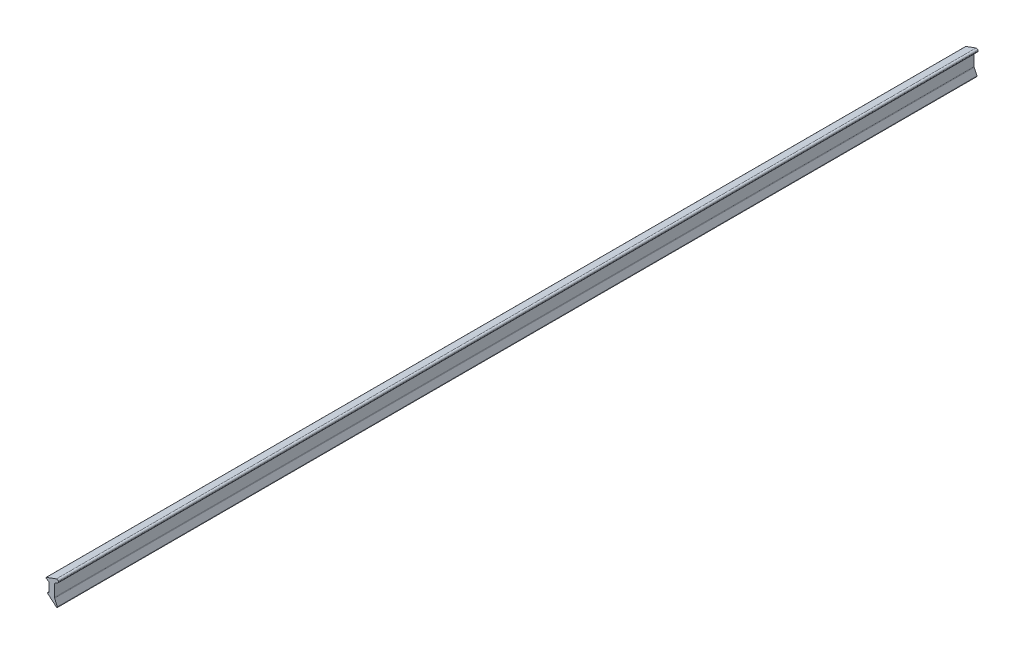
ISO-10303-21;
HEADER;
FILE_DESCRIPTION(('STEP AP214'),'2;1');
FILE_NAME('part.step','',(''),(''),'','','');
FILE_SCHEMA(('AUTOMOTIVE_DESIGN { 1 0 10303 214 1 1 1 1 }'));
ENDSEC;
DATA;
#1=APPLICATION_CONTEXT('core data for automotive mechanical design processes');
#2=APPLICATION_PROTOCOL_DEFINITION('international standard','automotive_design',2000,#1);
#3=PRODUCT_CONTEXT('',#1,'mechanical');
#4=PRODUCT('Part','Part','',(#3));
#5=PRODUCT_RELATED_PRODUCT_CATEGORY('part','',(#4));
#6=PRODUCT_DEFINITION_FORMATION('','',#4);
#7=PRODUCT_DEFINITION_CONTEXT('part definition',#1,'design');
#8=PRODUCT_DEFINITION('design','',#6,#7);
#9=PRODUCT_DEFINITION_SHAPE('','',#8);
#10=(LENGTH_UNIT() NAMED_UNIT(*) SI_UNIT(.MILLI.,.METRE.));
#11=(NAMED_UNIT(*) PLANE_ANGLE_UNIT() SI_UNIT($,.RADIAN.));
#12=(NAMED_UNIT(*) SI_UNIT($,.STERADIAN.) SOLID_ANGLE_UNIT());
#13=UNCERTAINTY_MEASURE_WITH_UNIT(LENGTH_MEASURE(1.E-05),#10,'distance_accuracy_value','');
#14=(GEOMETRIC_REPRESENTATION_CONTEXT(3) GLOBAL_UNCERTAINTY_ASSIGNED_CONTEXT((#13)) GLOBAL_UNIT_ASSIGNED_CONTEXT((#10,
#11,#12)) REPRESENTATION_CONTEXT('',''));
#15=CARTESIAN_POINT('',(0.,0.,0.));
#16=DIRECTION('',(0.,0.,1.));
#17=DIRECTION('',(1.,0.,0.));
#18=AXIS2_PLACEMENT_3D('',#15,#16,#17);
#19=CARTESIAN_POINT('',(0.,0.,150.));
#20=DIRECTION('',(0.324427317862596,-0.945910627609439,0.));
#21=DIRECTION('',(0.945910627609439,0.324427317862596,0.));
#22=AXIS2_PLACEMENT_3D('',#19,#20,#21);
#23=PLANE('',#22);
#24=DIRECTION('',(-0.945910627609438,-0.324427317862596,0.));
#25=VECTOR('',#24,1.);
#26=CARTESIAN_POINT('',(0.,0.,-150.));
#27=LINE('',#26,#25);
#28=CARTESIAN_POINT('',(0.,0.,-150.));
#29=VERTEX_POINT('',#28);
#30=CARTESIAN_POINT('',(-0.423103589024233,-0.145115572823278,-150.));
#31=VERTEX_POINT('',#30);
#32=EDGE_CURVE('E186',#29,#31,#27,.T.);
#33=ORIENTED_EDGE('',*,*,#32,.T.);
#34=DIRECTION('',(0.,0.,-1.));
#35=VECTOR('',#34,1.);
#36=CARTESIAN_POINT('',(-0.423103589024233,-0.145115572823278,150.));
#37=LINE('',#36,#35);
#38=CARTESIAN_POINT('',(-0.423103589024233,-0.145115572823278,150.));
#39=VERTEX_POINT('',#38);
#40=EDGE_CURVE('E52',#31,#39,#37,.F.);
#41=ORIENTED_EDGE('',*,*,#40,.T.);
#42=DIRECTION('',(-0.945910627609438,-0.324427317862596,0.));
#43=VECTOR('',#42,1.);
#44=CARTESIAN_POINT('',(0.,0.,150.));
#45=LINE('',#44,#43);
#46=CARTESIAN_POINT('',(0.,0.,150.));
#47=VERTEX_POINT('',#46);
#48=EDGE_CURVE('E206',#47,#39,#45,.T.);
#49=ORIENTED_EDGE('',*,*,#48,.F.);
#50=DIRECTION('',(0.,0.,-1.));
#51=VECTOR('',#50,1.);
#52=CARTESIAN_POINT('',(0.,0.,150.));
#53=LINE('',#52,#51);
#54=EDGE_CURVE('E185',#47,#29,#53,.T.);
#55=ORIENTED_EDGE('',*,*,#54,.T.);
#56=EDGE_LOOP('',(#33,#41,#49,#55));
#57=FACE_BOUND('',#56,.T.);
#58=ADVANCED_FACE('F37',(#57),#23,.F.);
#59=CARTESIAN_POINT('',(-0.756728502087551,-0.259541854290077,150.));
#60=DIRECTION('',(0.645190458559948,0.764021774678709,0.));
#61=DIRECTION('',(-0.764021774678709,0.645190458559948,0.));
#62=AXIS2_PLACEMENT_3D('',#59,#60,#61);
#63=PLANE('',#62);
#64=DIRECTION('',(0.764021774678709,-0.645190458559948,0.));
#65=VECTOR('',#64,1.);
#66=CARTESIAN_POINT('',(-0.756728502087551,-0.259541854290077,-150.));
#67=LINE('',#66,#65);
#68=CARTESIAN_POINT('',(-0.487256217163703,-0.487102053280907,-150.));
#69=VERTEX_POINT('',#68);
#70=CARTESIAN_POINT('',(2.37750854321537,-2.9062986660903,-150.));
#71=VERTEX_POINT('',#70);
#72=EDGE_CURVE('E188',#69,#71,#67,.T.);
#73=ORIENTED_EDGE('',*,*,#72,.T.);
#74=DIRECTION('',(0.,0.,-1.));
#75=VECTOR('',#74,1.);
#76=CARTESIAN_POINT('',(2.37750854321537,-2.9062986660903,150.));
#77=LINE('',#76,#75);
#78=CARTESIAN_POINT('',(2.37750854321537,-2.9062986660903,150.));
#79=VERTEX_POINT('',#78);
#80=EDGE_CURVE('E248',#71,#79,#77,.F.);
#81=ORIENTED_EDGE('',*,*,#80,.T.);
#82=DIRECTION('',(0.764021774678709,-0.645190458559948,0.));
#83=VECTOR('',#82,1.);
#84=CARTESIAN_POINT('',(-0.756728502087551,-0.259541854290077,150.));
#85=LINE('',#84,#83);
#86=CARTESIAN_POINT('',(-0.487256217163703,-0.487102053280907,150.));
#87=VERTEX_POINT('',#86);
#88=EDGE_CURVE('E273',#87,#79,#85,.T.);
#89=ORIENTED_EDGE('',*,*,#88,.F.);
#90=DIRECTION('',(0.,0.,-1.));
#91=VECTOR('',#90,1.);
#92=CARTESIAN_POINT('',(-0.487256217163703,-0.487102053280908,150.));
#93=LINE('',#92,#91);
#94=EDGE_CURVE('E245',#87,#69,#93,.T.);
#95=ORIENTED_EDGE('',*,*,#94,.T.);
#96=EDGE_LOOP('',(#73,#81,#89,#95));
#97=FACE_BOUND('',#96,.T.);
#98=ADVANCED_FACE('F308',(#97),#63,.F.);
#99=CARTESIAN_POINT('',(1.73575972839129,-0.599119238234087,150.));
#100=DIRECTION('',(-0.908503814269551,-0.417876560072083,0.));
#101=DIRECTION('',(0.417876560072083,-0.908503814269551,0.));
#102=AXIS2_PLACEMENT_3D('',#99,#100,#101);
#103=PLANE('',#102);
#104=DIRECTION('',(-0.417876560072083,0.908503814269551,0.));
#105=VECTOR('',#104,1.);
#106=CARTESIAN_POINT('',(1.73575972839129,-0.599119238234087,150.));
#107=LINE('',#106,#105);
#108=CARTESIAN_POINT('',(2.68824739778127,-2.66991899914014,150.));
#109=VERTEX_POINT('',#108);
#110=CARTESIAN_POINT('',(1.78150782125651,-0.698579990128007,150.));
#111=VERTEX_POINT('',#110);
#112=EDGE_CURVE('E157',#109,#111,#107,.T.);
#113=ORIENTED_EDGE('',*,*,#112,.F.);
#114=DIRECTION('',(0.,0.,-1.));
#115=VECTOR('',#114,1.);
#116=CARTESIAN_POINT('',(2.68824739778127,-2.66991899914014,150.));
#117=LINE('',#116,#115);
#118=CARTESIAN_POINT('',(2.68824739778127,-2.66991899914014,-150.));
#119=VERTEX_POINT('',#118);
#120=EDGE_CURVE('E236',#109,#119,#117,.T.);
#121=ORIENTED_EDGE('',*,*,#120,.T.);
#122=DIRECTION('',(-0.417876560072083,0.908503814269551,0.));
#123=VECTOR('',#122,1.);
#124=CARTESIAN_POINT('',(1.73575972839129,-0.599119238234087,-150.));
#125=LINE('',#124,#123);
#126=CARTESIAN_POINT('',(1.78150782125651,-0.698579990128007,-150.));
#127=VERTEX_POINT('',#126);
#128=EDGE_CURVE('E191',#119,#127,#125,.T.);
#129=ORIENTED_EDGE('',*,*,#128,.T.);
#130=DIRECTION('',(0.,0.,-1.));
#131=VECTOR('',#130,1.);
#132=CARTESIAN_POINT('',(1.78150782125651,-0.698579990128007,150.));
#133=LINE('',#132,#131);
#134=EDGE_CURVE('E212',#127,#111,#133,.F.);
#135=ORIENTED_EDGE('',*,*,#134,.T.);
#136=EDGE_LOOP('',(#113,#121,#129,#135));
#137=FACE_BOUND('',#136,.T.);
#138=ADVANCED_FACE('F281',(#137),#103,.F.);
#139=CARTESIAN_POINT('',(1.73575972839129,3.50918954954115,150.));
#140=DIRECTION('',(-1.,0.,0.));
#141=DIRECTION('',(0.,0.,1.));
#142=AXIS2_PLACEMENT_3D('',#139,#140,#141);
#143=PLANE('',#142);
#144=DIRECTION('',(0.,1.,0.));
#145=VECTOR('',#144,1.);
#146=CARTESIAN_POINT('',(1.73575972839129,3.50918954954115,150.));
#147=LINE('',#146,#145);
#148=CARTESIAN_POINT('',(1.73575972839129,-0.489641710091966,150.));
#149=VERTEX_POINT('',#148);
#150=CARTESIAN_POINT('',(1.73575972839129,3.50918954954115,150.));
#151=VERTEX_POINT('',#150);
#152=EDGE_CURVE('E145',#149,#151,#147,.T.);
#153=ORIENTED_EDGE('',*,*,#152,.F.);
#154=DIRECTION('',(0.,0.,-1.));
#155=VECTOR('',#154,1.);
#156=CARTESIAN_POINT('',(1.73575972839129,-0.489641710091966,-150.));
#157=LINE('',#156,#155);
#158=CARTESIAN_POINT('',(1.73575972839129,-0.489641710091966,-150.));
#159=VERTEX_POINT('',#158);
#160=EDGE_CURVE('E167',#149,#159,#157,.T.);
#161=ORIENTED_EDGE('',*,*,#160,.T.);
#162=DIRECTION('',(0.,1.,0.));
#163=VECTOR('',#162,1.);
#164=CARTESIAN_POINT('',(1.73575972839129,3.50918954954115,-150.));
#165=LINE('',#164,#163);
#166=CARTESIAN_POINT('',(1.73575972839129,3.50918954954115,-150.));
#167=VERTEX_POINT('',#166);
#168=EDGE_CURVE('E163',#159,#167,#165,.T.);
#169=ORIENTED_EDGE('',*,*,#168,.T.);
#170=DIRECTION('',(0.,0.,-1.));
#171=VECTOR('',#170,1.);
#172=CARTESIAN_POINT('',(1.73575972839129,3.50918954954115,150.));
#173=LINE('',#172,#171);
#174=EDGE_CURVE('E160',#151,#167,#173,.T.);
#175=ORIENTED_EDGE('',*,*,#174,.F.);
#176=EDGE_LOOP('',(#153,#161,#169,#175));
#177=FACE_BOUND('',#176,.T.);
#178=ADVANCED_FACE('F161',(#177),#143,.F.);
#179=CARTESIAN_POINT('',(3.06635444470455,4.2810565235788,150.));
#180=DIRECTION('',(-0.501777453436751,0.864996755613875,0.));
#181=DIRECTION('',(-0.864996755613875,-0.501777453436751,0.));
#182=AXIS2_PLACEMENT_3D('',#179,#180,#181);
#183=PLANE('',#182);
#184=DIRECTION('',(0.864996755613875,0.501777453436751,0.));
#185=VECTOR('',#184,1.);
#186=CARTESIAN_POINT('',(3.06635444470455,4.2810565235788,-150.));
#187=LINE('',#186,#185);
#188=CARTESIAN_POINT('',(2.7726091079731,4.11065728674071,-150.));
#189=VERTEX_POINT('',#188);
#190=EDGE_CURVE('E194',#167,#189,#187,.T.);
#191=ORIENTED_EDGE('',*,*,#190,.T.);
#192=DIRECTION('',(0.,0.,-1.));
#193=VECTOR('',#192,1.);
#194=CARTESIAN_POINT('',(2.7726091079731,4.11065728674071,150.));
#195=LINE('',#194,#193);
#196=CARTESIAN_POINT('',(2.7726091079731,4.11065728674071,150.));
#197=VERTEX_POINT('',#196);
#198=EDGE_CURVE('E172',#189,#197,#195,.F.);
#199=ORIENTED_EDGE('',*,*,#198,.T.);
#200=DIRECTION('',(0.864996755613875,0.501777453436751,0.));
#201=VECTOR('',#200,1.);
#202=CARTESIAN_POINT('',(3.06635444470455,4.2810565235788,150.));
#203=LINE('',#202,#201);
#204=EDGE_CURVE('E150',#151,#197,#203,.T.);
#205=ORIENTED_EDGE('',*,*,#204,.F.);
#206=ORIENTED_EDGE('',*,*,#174,.T.);
#207=EDGE_LOOP('',(#191,#199,#205,#206));
#208=FACE_BOUND('',#207,.T.);
#209=ADVANCED_FACE('F170',(#208),#183,.F.);
#210=CARTESIAN_POINT('',(2.91880416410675,5.27011107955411,150.));
#211=DIRECTION('',(-0.989054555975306,-0.147550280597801,0.));
#212=DIRECTION('',(0.147550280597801,-0.989054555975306,0.));
#213=AXIS2_PLACEMENT_3D('',#210,#211,#212);
#214=PLANE('',#213);
#215=DIRECTION('',(-0.147550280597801,0.989054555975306,0.));
#216=VECTOR('',#215,1.);
#217=CARTESIAN_POINT('',(2.91880416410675,5.27011107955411,-150.));
#218=LINE('',#217,#216);
#219=CARTESIAN_POINT('',(3.01624765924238,4.61693080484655,-150.));
#220=VERTEX_POINT('',#219);
#221=CARTESIAN_POINT('',(3.00912457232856,4.66467806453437,-150.));
#222=VERTEX_POINT('',#221);
#223=EDGE_CURVE('E196',#220,#222,#218,.T.);
#224=ORIENTED_EDGE('',*,*,#223,.T.);
#225=DIRECTION('',(0.,0.,-1.));
#226=VECTOR('',#225,1.);
#227=CARTESIAN_POINT('',(3.00912457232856,4.66467806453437,150.));
#228=LINE('',#227,#226);
#229=CARTESIAN_POINT('',(3.00912457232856,4.66467806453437,150.));
#230=VERTEX_POINT('',#229);
#231=EDGE_CURVE('E225',#222,#230,#228,.F.);
#232=ORIENTED_EDGE('',*,*,#231,.T.);
#233=DIRECTION('',(-0.147550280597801,0.989054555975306,0.));
#234=VECTOR('',#233,1.);
#235=CARTESIAN_POINT('',(2.91880416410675,5.27011107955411,150.));
#236=LINE('',#235,#234);
#237=CARTESIAN_POINT('',(3.01624765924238,4.61693080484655,150.));
#238=VERTEX_POINT('',#237);
#239=EDGE_CURVE('E173',#238,#230,#236,.T.);
#240=ORIENTED_EDGE('',*,*,#239,.F.);
#241=DIRECTION('',(0.,0.,-1.));
#242=VECTOR('',#241,1.);
#243=CARTESIAN_POINT('',(3.01624765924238,4.61693080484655,150.));
#244=LINE('',#243,#242);
#245=EDGE_CURVE('E222',#238,#220,#244,.T.);
#246=ORIENTED_EDGE('',*,*,#245,.T.);
#247=EDGE_LOOP('',(#224,#232,#240,#246));
#248=FACE_BOUND('',#247,.T.);
#249=ADVANCED_FACE('F291',(#248),#214,.F.);
#250=CARTESIAN_POINT('',(-1.30981262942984,3.7310204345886,150.));
#251=DIRECTION('',(0.342020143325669,-0.939692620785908,0.));
#252=DIRECTION('',(0.939692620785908,0.34202014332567,0.));
#253=AXIS2_PLACEMENT_3D('',#250,#251,#252);
#254=PLANE('',#253);
#255=DIRECTION('',(-0.939692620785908,-0.342020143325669,0.));
#256=VECTOR('',#255,1.);
#257=CARTESIAN_POINT('',(-1.30981262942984,3.7310204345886,-150.));
#258=LINE('',#257,#256);
#259=CARTESIAN_POINT('',(2.34358722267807,5.06074923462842,-150.));
#260=VERTEX_POINT('',#259);
#261=CARTESIAN_POINT('',(-0.899000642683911,3.88054376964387,-150.));
#262=VERTEX_POINT('',#261);
#263=EDGE_CURVE('E199',#260,#262,#258,.T.);
#264=ORIENTED_EDGE('',*,*,#263,.T.);
#265=DIRECTION('',(0.,0.,-1.));
#266=VECTOR('',#265,1.);
#267=CARTESIAN_POINT('',(-0.899000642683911,3.88054376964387,150.));
#268=LINE('',#267,#266);
#269=CARTESIAN_POINT('',(-0.899000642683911,3.88054376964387,150.));
#270=VERTEX_POINT('',#269);
#271=EDGE_CURVE('E11',#262,#270,#268,.F.);
#272=ORIENTED_EDGE('',*,*,#271,.T.);
#273=DIRECTION('',(-0.939692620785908,-0.342020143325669,0.));
#274=VECTOR('',#273,1.);
#275=CARTESIAN_POINT('',(-1.30981262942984,3.7310204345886,150.));
#276=LINE('',#275,#274);
#277=CARTESIAN_POINT('',(2.34358722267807,5.06074923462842,150.));
#278=VERTEX_POINT('',#277);
#279=EDGE_CURVE('E176',#278,#270,#276,.T.);
#280=ORIENTED_EDGE('',*,*,#279,.F.);
#281=DIRECTION('',(0.,0.,-1.));
#282=VECTOR('',#281,1.);
#283=CARTESIAN_POINT('',(2.34358722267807,5.06074923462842,150.));
#284=LINE('',#283,#282);
#285=EDGE_CURVE('E215',#278,#260,#284,.T.);
#286=ORIENTED_EDGE('',*,*,#285,.T.);
#287=EDGE_LOOP('',(#264,#272,#280,#286));
#288=FACE_BOUND('',#287,.T.);
#289=ADVANCED_FACE('F298',(#288),#254,.F.);
#290=CARTESIAN_POINT('',(0.,3.,150.));
#291=DIRECTION('',(0.487346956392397,0.873208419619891,0.));
#292=DIRECTION('',(-0.873208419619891,0.487346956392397,0.));
#293=AXIS2_PLACEMENT_3D('',#290,#291,#292);
#294=PLANE('',#293);
#295=DIRECTION('',(0.873208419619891,-0.487346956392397,0.));
#296=VECTOR('',#295,1.);
#297=CARTESIAN_POINT('',(0.,3.,150.));
#298=LINE('',#297,#296);
#299=CARTESIAN_POINT('',(-0.928066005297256,3.51796356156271,150.));
#300=VERTEX_POINT('',#299);
#301=CARTESIAN_POINT('',(0.,3.,150.));
#302=VERTEX_POINT('',#301);
#303=EDGE_CURVE('E181',#300,#302,#298,.T.);
#304=ORIENTED_EDGE('',*,*,#303,.F.);
#305=DIRECTION('',(0.,0.,-1.));
#306=VECTOR('',#305,1.);
#307=CARTESIAN_POINT('',(-0.928066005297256,3.51796356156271,150.));
#308=LINE('',#307,#306);
#309=CARTESIAN_POINT('',(-0.928066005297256,3.51796356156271,-150.));
#310=VERTEX_POINT('',#309);
#311=EDGE_CURVE('E45',#300,#310,#308,.T.);
#312=ORIENTED_EDGE('',*,*,#311,.T.);
#313=DIRECTION('',(0.873208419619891,-0.487346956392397,0.));
#314=VECTOR('',#313,1.);
#315=CARTESIAN_POINT('',(0.,3.,-150.));
#316=LINE('',#315,#314);
#317=CARTESIAN_POINT('',(0.,3.,-150.));
#318=VERTEX_POINT('',#317);
#319=EDGE_CURVE('E202',#310,#318,#316,.T.);
#320=ORIENTED_EDGE('',*,*,#319,.T.);
#321=DIRECTION('',(0.,0.,-1.));
#322=VECTOR('',#321,1.);
#323=CARTESIAN_POINT('',(0.,3.,150.));
#324=LINE('',#323,#322);
#325=EDGE_CURVE('E168',#302,#318,#324,.T.);
#326=ORIENTED_EDGE('',*,*,#325,.F.);
#327=EDGE_LOOP('',(#304,#312,#320,#326));
#328=FACE_BOUND('',#327,.T.);
#329=ADVANCED_FACE('F259',(#328),#294,.F.);
#330=CARTESIAN_POINT('',(0.,0.,150.));
#331=DIRECTION('',(1.,0.,0.));
#332=DIRECTION('',(0.,0.,-1.));
#333=AXIS2_PLACEMENT_3D('',#330,#331,#332);
#334=PLANE('',#333);
#335=DIRECTION('',(0.,-1.,0.));
#336=VECTOR('',#335,1.);
#337=CARTESIAN_POINT('',(0.,0.,-150.));
#338=LINE('',#337,#336);
#339=EDGE_CURVE('E204',#318,#29,#338,.T.);
#340=ORIENTED_EDGE('',*,*,#339,.T.);
#341=ORIENTED_EDGE('',*,*,#54,.F.);
#342=DIRECTION('',(0.,-1.,0.));
#343=VECTOR('',#342,1.);
#344=CARTESIAN_POINT('',(0.,0.,150.));
#345=LINE('',#344,#343);
#346=EDGE_CURVE('E183',#302,#47,#345,.T.);
#347=ORIENTED_EDGE('',*,*,#346,.F.);
#348=ORIENTED_EDGE('',*,*,#325,.T.);
#349=EDGE_LOOP('',(#340,#341,#347,#348));
#350=FACE_BOUND('',#349,.T.);
#351=ADVANCED_FACE('F270',(#350),#334,.F.);
#352=CARTESIAN_POINT('',(0.,0.,150.));
#353=DIRECTION('',(0.,0.,1.));
#354=DIRECTION('',(1.,0.,0.));
#355=AXIS2_PLACEMENT_3D('',#352,#353,#354);
#356=PLANE('',#355);
#357=ORIENTED_EDGE('',*,*,#88,.T.);
#358=CARTESIAN_POINT('',(2.50654663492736,-2.75349431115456,150.));
#359=DIRECTION('',(0.,0.,1.));
#360=DIRECTION('',(1.,0.,0.));
#361=AXIS2_PLACEMENT_3D('',#358,#359,#360);
#362=CIRCLE('',#361,0.2);
#363=EDGE_CURVE('E253',#79,#109,#362,.T.);
#364=ORIENTED_EDGE('',*,*,#363,.T.);
#365=ORIENTED_EDGE('',*,*,#112,.T.);
#366=CARTESIAN_POINT('',(2.23575972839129,-0.489641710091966,150.));
#367=DIRECTION('',(0.,0.,1.));
#368=DIRECTION('',(1.,0.,0.));
#369=AXIS2_PLACEMENT_3D('',#366,#367,#368);
#370=CIRCLE('',#369,0.5);
#371=EDGE_CURVE('E153',#111,#149,#370,.F.);
#372=ORIENTED_EDGE('',*,*,#371,.T.);
#373=ORIENTED_EDGE('',*,*,#152,.T.);
#374=ORIENTED_EDGE('',*,*,#204,.T.);
#375=CARTESIAN_POINT('',(2.52172038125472,4.54315566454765,150.));
#376=DIRECTION('',(0.,0.,1.));
#377=DIRECTION('',(1.,0.,0.));
#378=AXIS2_PLACEMENT_3D('',#375,#376,#377);
#379=CIRCLE('',#378,0.5);
#380=EDGE_CURVE('E227',#197,#238,#379,.T.);
#381=ORIENTED_EDGE('',*,*,#380,.T.);
#382=ORIENTED_EDGE('',*,*,#239,.T.);
#383=CARTESIAN_POINT('',(2.51459729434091,4.59090292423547,150.));
#384=DIRECTION('',(0.,0.,1.));
#385=DIRECTION('',(1.,0.,0.));
#386=AXIS2_PLACEMENT_3D('',#383,#384,#385);
#387=CIRCLE('',#386,0.5);
#388=EDGE_CURVE('E229',#230,#278,#387,.T.);
#389=ORIENTED_EDGE('',*,*,#388,.T.);
#390=ORIENTED_EDGE('',*,*,#279,.T.);
#391=CARTESIAN_POINT('',(-0.830596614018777,3.69260524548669,150.));
#392=DIRECTION('',(0.,0.,1.));
#393=DIRECTION('',(1.,0.,0.));
#394=AXIS2_PLACEMENT_3D('',#391,#392,#393);
#395=CIRCLE('',#394,0.2);
#396=EDGE_CURVE('E60',#270,#300,#395,.T.);
#397=ORIENTED_EDGE('',*,*,#396,.T.);
#398=ORIENTED_EDGE('',*,*,#303,.T.);
#399=ORIENTED_EDGE('',*,*,#346,.T.);
#400=ORIENTED_EDGE('',*,*,#48,.T.);
#401=CARTESIAN_POINT('',(-0.358218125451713,-0.334297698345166,150.));
#402=DIRECTION('',(0.,0.,1.));
#403=DIRECTION('',(1.,0.,0.));
#404=AXIS2_PLACEMENT_3D('',#401,#402,#403);
#405=CIRCLE('',#404,0.2);
#406=EDGE_CURVE('E251',#39,#87,#405,.T.);
#407=ORIENTED_EDGE('',*,*,#406,.T.);
#408=EDGE_LOOP('',(#357,#364,#365,#372,#373,#374,#381,#382,#389,#390,#397,#398,#399,#400,#407));
#409=FACE_BOUND('',#408,.T.);
#410=ADVANCED_FACE('F148',(#409),#356,.T.);
#411=CARTESIAN_POINT('',(0.,0.,-150.));
#412=DIRECTION('',(0.,0.,1.));
#413=DIRECTION('',(1.,0.,0.));
#414=AXIS2_PLACEMENT_3D('',#411,#412,#413);
#415=PLANE('',#414);
#416=ORIENTED_EDGE('',*,*,#128,.F.);
#417=CARTESIAN_POINT('',(2.50654663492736,-2.75349431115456,-150.));
#418=DIRECTION('',(0.,0.,1.));
#419=DIRECTION('',(1.,0.,0.));
#420=AXIS2_PLACEMENT_3D('',#417,#418,#419);
#421=CIRCLE('',#420,0.2);
#422=EDGE_CURVE('E243',#119,#71,#421,.F.);
#423=ORIENTED_EDGE('',*,*,#422,.T.);
#424=ORIENTED_EDGE('',*,*,#72,.F.);
#425=CARTESIAN_POINT('',(-0.358218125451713,-0.334297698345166,-150.));
#426=DIRECTION('',(0.,0.,1.));
#427=DIRECTION('',(1.,0.,0.));
#428=AXIS2_PLACEMENT_3D('',#425,#426,#427);
#429=CIRCLE('',#428,0.2);
#430=EDGE_CURVE('E241',#69,#31,#429,.F.);
#431=ORIENTED_EDGE('',*,*,#430,.T.);
#432=ORIENTED_EDGE('',*,*,#32,.F.);
#433=ORIENTED_EDGE('',*,*,#339,.F.);
#434=ORIENTED_EDGE('',*,*,#319,.F.);
#435=CARTESIAN_POINT('',(-0.830596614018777,3.69260524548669,-150.));
#436=DIRECTION('',(0.,0.,1.));
#437=DIRECTION('',(1.,0.,0.));
#438=AXIS2_PLACEMENT_3D('',#435,#436,#437);
#439=CIRCLE('',#438,0.2);
#440=EDGE_CURVE('E239',#310,#262,#439,.F.);
#441=ORIENTED_EDGE('',*,*,#440,.T.);
#442=ORIENTED_EDGE('',*,*,#263,.F.);
#443=CARTESIAN_POINT('',(2.51459729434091,4.59090292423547,-150.));
#444=DIRECTION('',(0.,0.,1.));
#445=DIRECTION('',(1.,0.,0.));
#446=AXIS2_PLACEMENT_3D('',#443,#444,#445);
#447=CIRCLE('',#446,0.5);
#448=EDGE_CURVE('E220',#260,#222,#447,.F.);
#449=ORIENTED_EDGE('',*,*,#448,.T.);
#450=ORIENTED_EDGE('',*,*,#223,.F.);
#451=CARTESIAN_POINT('',(2.52172038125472,4.54315566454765,-150.));
#452=DIRECTION('',(0.,0.,1.));
#453=DIRECTION('',(1.,0.,0.));
#454=AXIS2_PLACEMENT_3D('',#451,#452,#453);
#455=CIRCLE('',#454,0.5);
#456=EDGE_CURVE('E218',#220,#189,#455,.F.);
#457=ORIENTED_EDGE('',*,*,#456,.T.);
#458=ORIENTED_EDGE('',*,*,#190,.F.);
#459=ORIENTED_EDGE('',*,*,#168,.F.);
#460=CARTESIAN_POINT('',(2.23575972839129,-0.489641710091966,-150.));
#461=DIRECTION('',(0.,0.,1.));
#462=DIRECTION('',(1.,0.,0.));
#463=AXIS2_PLACEMENT_3D('',#460,#461,#462);
#464=CIRCLE('',#463,0.5);
#465=EDGE_CURVE('E232',#159,#127,#464,.T.);
#466=ORIENTED_EDGE('',*,*,#465,.T.);
#467=EDGE_LOOP('',(#416,#423,#424,#431,#432,#433,#434,#441,#442,#449,#450,#457,#458,#459,#466));
#468=FACE_BOUND('',#467,.T.);
#469=ADVANCED_FACE('F265',(#468),#415,.F.);
#470=CARTESIAN_POINT('',(2.23575972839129,-0.489641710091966,150.));
#471=DIRECTION('',(0.,0.,1.));
#472=DIRECTION('',(1.,0.,0.));
#473=AXIS2_PLACEMENT_3D('',#470,#471,#472);
#474=CYLINDRICAL_SURFACE('',#473,0.5);
#475=ORIENTED_EDGE('',*,*,#371,.F.);
#476=ORIENTED_EDGE('',*,*,#134,.F.);
#477=ORIENTED_EDGE('',*,*,#465,.F.);
#478=ORIENTED_EDGE('',*,*,#160,.F.);
#479=EDGE_LOOP('',(#475,#476,#477,#478));
#480=FACE_BOUND('',#479,.T.);
#481=ADVANCED_FACE('F283',(#480),#474,.F.);
#482=CARTESIAN_POINT('',(2.51459729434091,4.59090292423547,150.));
#483=DIRECTION('',(0.,0.,-1.));
#484=DIRECTION('',(-1.,0.,0.));
#485=AXIS2_PLACEMENT_3D('',#482,#483,#484);
#486=CYLINDRICAL_SURFACE('',#485,0.5);
#487=ORIENTED_EDGE('',*,*,#388,.F.);
#488=ORIENTED_EDGE('',*,*,#231,.F.);
#489=ORIENTED_EDGE('',*,*,#448,.F.);
#490=ORIENTED_EDGE('',*,*,#285,.F.);
#491=EDGE_LOOP('',(#487,#488,#489,#490));
#492=FACE_BOUND('',#491,.T.);
#493=ADVANCED_FACE('F294',(#492),#486,.T.);
#494=CARTESIAN_POINT('',(2.52172038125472,4.54315566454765,150.));
#495=DIRECTION('',(0.,0.,-1.));
#496=DIRECTION('',(-1.,0.,0.));
#497=AXIS2_PLACEMENT_3D('',#494,#495,#496);
#498=CYLINDRICAL_SURFACE('',#497,0.5);
#499=ORIENTED_EDGE('',*,*,#380,.F.);
#500=ORIENTED_EDGE('',*,*,#198,.F.);
#501=ORIENTED_EDGE('',*,*,#456,.F.);
#502=ORIENTED_EDGE('',*,*,#245,.F.);
#503=EDGE_LOOP('',(#499,#500,#501,#502));
#504=FACE_BOUND('',#503,.T.);
#505=ADVANCED_FACE('F286',(#504),#498,.T.);
#506=CARTESIAN_POINT('',(2.50654663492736,-2.75349431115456,150.));
#507=DIRECTION('',(0.,0.,-1.));
#508=DIRECTION('',(-1.,0.,0.));
#509=AXIS2_PLACEMENT_3D('',#506,#507,#508);
#510=CYLINDRICAL_SURFACE('',#509,0.2);
#511=ORIENTED_EDGE('',*,*,#363,.F.);
#512=ORIENTED_EDGE('',*,*,#80,.F.);
#513=ORIENTED_EDGE('',*,*,#422,.F.);
#514=ORIENTED_EDGE('',*,*,#120,.F.);
#515=EDGE_LOOP('',(#511,#512,#513,#514));
#516=FACE_BOUND('',#515,.T.);
#517=ADVANCED_FACE('F305',(#516),#510,.T.);
#518=CARTESIAN_POINT('',(-0.358218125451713,-0.334297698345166,150.));
#519=DIRECTION('',(0.,0.,-1.));
#520=DIRECTION('',(-1.,0.,0.));
#521=AXIS2_PLACEMENT_3D('',#518,#519,#520);
#522=CYLINDRICAL_SURFACE('',#521,0.2);
#523=ORIENTED_EDGE('',*,*,#406,.F.);
#524=ORIENTED_EDGE('',*,*,#40,.F.);
#525=ORIENTED_EDGE('',*,*,#430,.F.);
#526=ORIENTED_EDGE('',*,*,#94,.F.);
#527=EDGE_LOOP('',(#523,#524,#525,#526));
#528=FACE_BOUND('',#527,.T.);
#529=ADVANCED_FACE('F301',(#528),#522,.T.);
#530=CARTESIAN_POINT('',(-0.830596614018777,3.69260524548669,150.));
#531=DIRECTION('',(0.,0.,-1.));
#532=DIRECTION('',(-1.,0.,0.));
#533=AXIS2_PLACEMENT_3D('',#530,#531,#532);
#534=CYLINDRICAL_SURFACE('',#533,0.2);
#535=ORIENTED_EDGE('',*,*,#396,.F.);
#536=ORIENTED_EDGE('',*,*,#271,.F.);
#537=ORIENTED_EDGE('',*,*,#440,.F.);
#538=ORIENTED_EDGE('',*,*,#311,.F.);
#539=EDGE_LOOP('',(#535,#536,#537,#538));
#540=FACE_BOUND('',#539,.T.);
#541=ADVANCED_FACE('F39',(#540),#534,.T.);
#542=CLOSED_SHELL('',(#58,#98,#138,#178,#209,#249,#289,#329,#351,#410,#469,#481,#493,#505,#517,
#529,#541));
#543=MANIFOLD_SOLID_BREP('B2',#542);
#544=ADVANCED_BREP_SHAPE_REPRESENTATION('',(#18,#543),#14);
#545=SHAPE_DEFINITION_REPRESENTATION(#9,#544);
ENDSEC;
END-ISO-10303-21;
